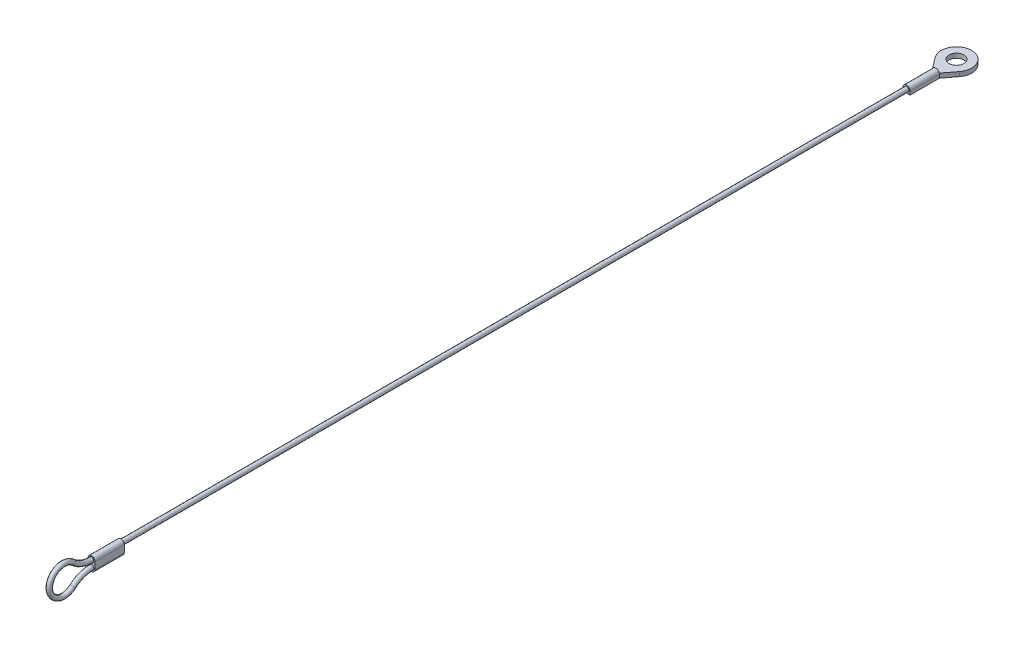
from build123d import *

# Parameters (mm, degrees)
SKETCH2_R           = 0.795
BOSS_EXTRUDE1_DEPTH = 10
BOSS_EXTRUDE2_DEPTH = 10
SKETCH5_R           = 2.54
BOSS_EXTRUDE3_DEPTH = 1.52


with BuildPart() as part:
    # Sweep1: sweep along a path in Sketch1
    with BuildLine(Plane(origin=(0, 0, 0), x_dir=(0, 0, -1), z_dir=(1, 0, 0))) as sweep1_path:
        Line((0, 0), (-278.2, 0))
        ThreePointArc((-278.2, 0), (-281.625492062, 0.631945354), (-284.6, 2.444582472))
        ThreePointArc((-284.6, 2.444582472), (-292.6, -1.133126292), (-284.6, -4.710835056))
        ThreePointArc((-284.6, -4.710835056), (-281.625492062, -2.898197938), (-278.2, -2.266252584))
    # Sketch2 → Sweep1 (sweep)
    with BuildSketch(Plane.XY):
        Circle(SKETCH2_R)
    sweep(path=sweep1_path.line)

    # Sketch3 → Boss-Extrude1 (add)
    with BuildSketch(Plane(origin=(0, 0, 278.2), x_dir=(-1, 0, 0), z_dir=(0, 0, -1))):
        with BuildLine():
            Line((1.195, 0), (1.195, -2.266252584))
            ThreePointArc((1.195, -2.266252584), (0, -3.461252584), (-1.195, -2.266252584))
            Line((-1.195, -2.266252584), (-1.195, 0))
            ThreePointArc((-1.195, 0), (0, 1.195), (1.195, 0))
        make_face()
    extrude(amount=BOSS_EXTRUDE1_DEPTH)

    # Sketch4 → Boss-Extrude2 (add)
    with BuildSketch(Plane(origin=(0, 0, 0), x_dir=(-1, 0, 0), z_dir=(0, 0, -1))):
        with BuildLine():
            Line((-1.195, 0), (-1.195, -1.195))
            Line((-1.195, -1.195), (0, -1.195))
            Line((0, -1.195), (1.195, -1.195))
            Line((1.195, -1.195), (1.195, 0))
            ThreePointArc((1.195, 0), (0, 1.195), (-1.195, 0))
        make_face()
    extrude(amount=BOSS_EXTRUDE2_DEPTH)

    # Sketch5 → Boss-Extrude3 (add)
    with BuildSketch(Plane.XZ.offset(1.195)):
        with BuildLine():
            Line((-1.195, -10), (1.195, -10))
            Line((1.195, -10), (4.132281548, -13.835150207))
            ThreePointArc((4.132281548, -13.835150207), (0, -22.205), (-4.132281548, -13.835150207))
            Line((-4.132281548, -13.835150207), (-1.195, -10))
        make_face()
        with Locations(Location((0, -17, 0), (0, 0, 270))):
            Circle(SKETCH5_R, mode=Mode.SUBTRACT)
    extrude(amount=-BOSS_EXTRUDE3_DEPTH)


solid = part.part
